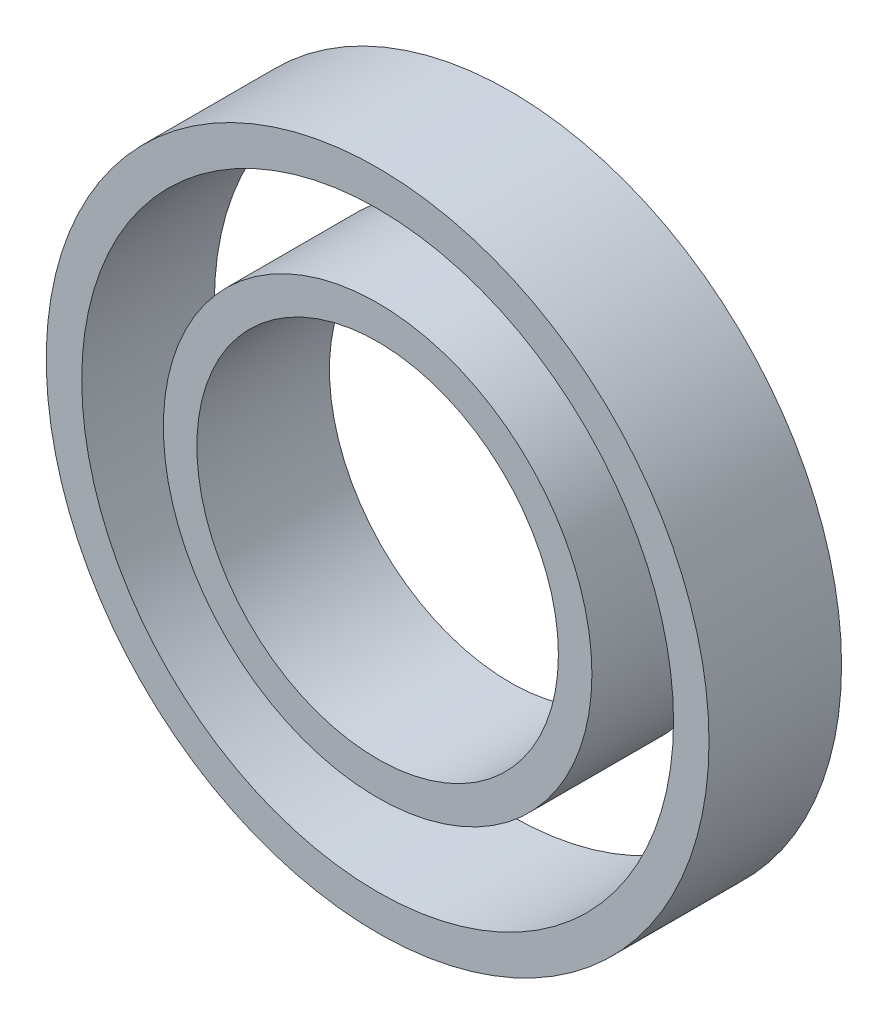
from build123d import *

# Parameters (mm, degrees)
SKETCH1_R        = 35.56
SKETCH1_R_2      = 29.9974
EXTRUDE2_DEPTH   = 10.9982
SKETCH1_R_3      = 54.991
SKETCH1_R_4      = 49.101752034
EXTRUDE2_2_DEPTH = 10.9982


with BuildPart() as part:
    # Sketch1 → Extrude2 (new, symmetric)
    with BuildSketch(Plane.XY):
        Circle(SKETCH1_R)
        Circle(SKETCH1_R_2, mode=Mode.SUBTRACT)
    extrude(amount=EXTRUDE2_DEPTH, both=True)


with BuildPart() as body_2:
    # Sketch1 → Extrude2 2 (new, symmetric)
    with BuildSketch(Plane.XY):
        Circle(SKETCH1_R_3)
        Circle(SKETCH1_R_4, mode=Mode.SUBTRACT)
    extrude(amount=EXTRUDE2_2_DEPTH, both=True)


solid = Compound([part.part, body_2.part])
